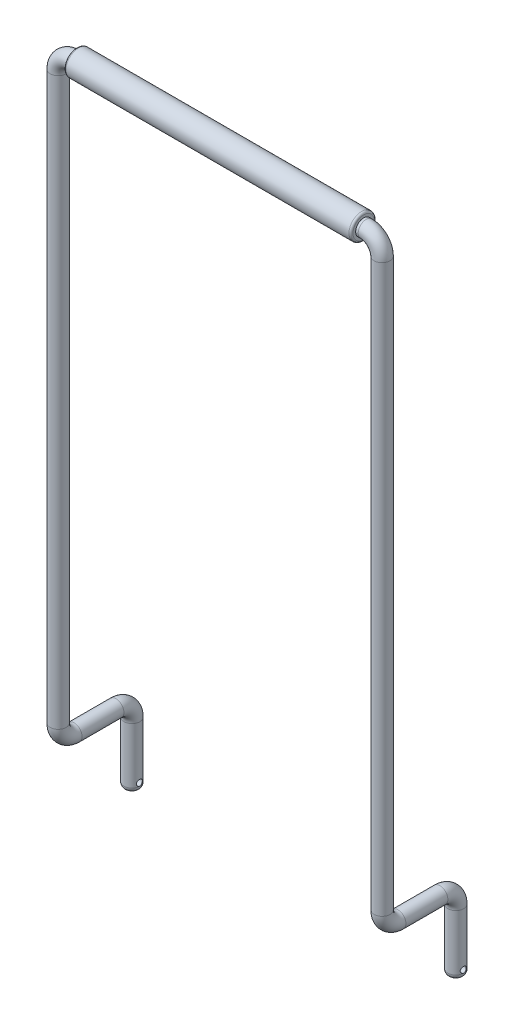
ISO-10303-21;
HEADER;
FILE_DESCRIPTION(('STEP AP214'),'2;1');
FILE_NAME('part.step','',(''),(''),'','','');
FILE_SCHEMA(('AUTOMOTIVE_DESIGN { 1 0 10303 214 1 1 1 1 }'));
ENDSEC;
DATA;
#1=APPLICATION_CONTEXT('core data for automotive mechanical design processes');
#2=APPLICATION_PROTOCOL_DEFINITION('international standard','automotive_design',2000,#1);
#3=PRODUCT_CONTEXT('',#1,'mechanical');
#4=PRODUCT('Part','Part','',(#3));
#5=PRODUCT_RELATED_PRODUCT_CATEGORY('part','',(#4));
#6=PRODUCT_DEFINITION_FORMATION('','',#4);
#7=PRODUCT_DEFINITION_CONTEXT('part definition',#1,'design');
#8=PRODUCT_DEFINITION('design','',#6,#7);
#9=PRODUCT_DEFINITION_SHAPE('','',#8);
#10=(LENGTH_UNIT() NAMED_UNIT(*) SI_UNIT(.MILLI.,.METRE.));
#11=(NAMED_UNIT(*) PLANE_ANGLE_UNIT() SI_UNIT($,.RADIAN.));
#12=(NAMED_UNIT(*) SI_UNIT($,.STERADIAN.) SOLID_ANGLE_UNIT());
#13=UNCERTAINTY_MEASURE_WITH_UNIT(LENGTH_MEASURE(1.E-05),#10,'distance_accuracy_value','');
#14=(GEOMETRIC_REPRESENTATION_CONTEXT(3) GLOBAL_UNCERTAINTY_ASSIGNED_CONTEXT((#13)) GLOBAL_UNIT_ASSIGNED_CONTEXT((#10,
#11,#12)) REPRESENTATION_CONTEXT('',''));
#15=CARTESIAN_POINT('',(0.,0.,0.));
#16=DIRECTION('',(0.,0.,1.));
#17=DIRECTION('',(1.,0.,0.));
#18=AXIS2_PLACEMENT_3D('',#15,#16,#17);
#19=CARTESIAN_POINT('',(72.,0.,0.));
#20=DIRECTION('',(-1.,0.,0.));
#21=DIRECTION('',(0.,0.,1.));
#22=AXIS2_PLACEMENT_3D('',#19,#20,#21);
#23=CYLINDRICAL_SURFACE('',#22,6.35);
#24=CARTESIAN_POINT('',(71.,0.,0.));
#25=DIRECTION('',(1.,0.,0.));
#26=DIRECTION('',(0.,0.,-1.));
#27=AXIS2_PLACEMENT_3D('',#24,#25,#26);
#28=CIRCLE('',#27,6.35);
#29=CARTESIAN_POINT('',(71.,0.,-6.35));
#30=VERTEX_POINT('',#29);
#31=EDGE_CURVE('E53',#30,#30,#28,.F.);
#32=ORIENTED_EDGE('',*,*,#31,.T.);
#33=EDGE_LOOP('',(#32));
#34=FACE_BOUND('',#33,.T.);
#35=CARTESIAN_POINT('',(-71.,0.,0.));
#36=DIRECTION('',(1.,0.,0.));
#37=DIRECTION('',(0.,0.,-1.));
#38=AXIS2_PLACEMENT_3D('',#35,#36,#37);
#39=CIRCLE('',#38,6.35);
#40=CARTESIAN_POINT('',(-71.,0.,-6.35));
#41=VERTEX_POINT('',#40);
#42=EDGE_CURVE('E57',#41,#41,#39,.T.);
#43=ORIENTED_EDGE('',*,*,#42,.T.);
#44=EDGE_LOOP('',(#43));
#45=FACE_BOUND('',#44,.T.);
#46=ADVANCED_FACE('F46',(#34,#45),#23,.T.);
#47=CARTESIAN_POINT('',(72.,0.,0.));
#48=DIRECTION('',(1.,0.,0.));
#49=DIRECTION('',(0.,0.,-1.));
#50=AXIS2_PLACEMENT_3D('',#47,#48,#49);
#51=PLANE('',#50);
#52=CARTESIAN_POINT('',(72.,0.,0.));
#53=DIRECTION('',(1.,0.,0.));
#54=DIRECTION('',(0.,0.,-1.));
#55=AXIS2_PLACEMENT_3D('',#52,#53,#54);
#56=CIRCLE('',#55,5.35);
#57=CARTESIAN_POINT('',(72.,0.,-5.35));
#58=VERTEX_POINT('',#57);
#59=EDGE_CURVE('E61',#58,#58,#56,.T.);
#60=ORIENTED_EDGE('',*,*,#59,.T.);
#61=EDGE_LOOP('',(#60));
#62=FACE_BOUND('',#61,.T.);
#63=ADVANCED_FACE('F67',(#62),#51,.T.);
#64=CARTESIAN_POINT('',(-72.,0.,0.));
#65=DIRECTION('',(1.,0.,0.));
#66=DIRECTION('',(0.,0.,-1.));
#67=AXIS2_PLACEMENT_3D('',#64,#65,#66);
#68=PLANE('',#67);
#69=CARTESIAN_POINT('',(-72.,0.,0.));
#70=DIRECTION('',(1.,0.,0.));
#71=DIRECTION('',(0.,0.,-1.));
#72=AXIS2_PLACEMENT_3D('',#69,#70,#71);
#73=CIRCLE('',#72,5.35);
#74=CARTESIAN_POINT('',(-72.,0.,-5.35));
#75=VERTEX_POINT('',#74);
#76=EDGE_CURVE('E11',#75,#75,#73,.F.);
#77=ORIENTED_EDGE('',*,*,#76,.T.);
#78=EDGE_LOOP('',(#77));
#79=FACE_BOUND('',#78,.T.);
#80=ADVANCED_FACE('F71',(#79),#68,.F.);
#81=CARTESIAN_POINT('',(71.,0.,0.));
#82=DIRECTION('',(1.,0.,0.));
#83=DIRECTION('',(0.,0.,-1.));
#84=AXIS2_PLACEMENT_3D('',#81,#82,#83);
#85=TOROIDAL_SURFACE('',#84,5.35,1.);
#86=ORIENTED_EDGE('',*,*,#31,.F.);
#87=EDGE_LOOP('',(#86));
#88=FACE_BOUND('',#87,.T.);
#89=ORIENTED_EDGE('',*,*,#59,.F.);
#90=EDGE_LOOP('',(#89));
#91=FACE_BOUND('',#90,.T.);
#92=ADVANCED_FACE('F69',(#88,#91),#85,.T.);
#93=CARTESIAN_POINT('',(-71.,0.,0.));
#94=DIRECTION('',(1.,0.,0.));
#95=DIRECTION('',(0.,0.,-1.));
#96=AXIS2_PLACEMENT_3D('',#93,#94,#95);
#97=TOROIDAL_SURFACE('',#96,5.35,1.);
#98=ORIENTED_EDGE('',*,*,#76,.F.);
#99=EDGE_LOOP('',(#98));
#100=FACE_BOUND('',#99,.T.);
#101=ORIENTED_EDGE('',*,*,#42,.F.);
#102=EDGE_LOOP('',(#101));
#103=FACE_BOUND('',#102,.T.);
#104=ADVANCED_FACE('F48',(#100,#103),#97,.T.);
#105=CLOSED_SHELL('',(#46,#63,#80,#92,#104));
#106=MANIFOLD_SOLID_BREP('B2',#105);
#107=CARTESIAN_POINT('',(0.,0.,0.));
#108=DIRECTION('',(-1.,0.,0.));
#109=DIRECTION('',(0.,-1.,0.));
#110=AXIS2_PLACEMENT_3D('',#107,#108,#109);
#111=CYLINDRICAL_SURFACE('',#110,4.);
#112=CARTESIAN_POINT('',(-73.25,0.,0.));
#113=DIRECTION('',(1.,0.,0.));
#114=DIRECTION('',(0.,0.,-1.));
#115=AXIS2_PLACEMENT_3D('',#112,#113,#114);
#116=CIRCLE('',#115,4.);
#117=CARTESIAN_POINT('',(-73.25,3.99999999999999,0.));
#118=VERTEX_POINT('',#117);
#119=EDGE_CURVE('E277',#118,#118,#116,.T.);
#120=ORIENTED_EDGE('',*,*,#119,.T.);
#121=EDGE_LOOP('',(#120));
#122=FACE_BOUND('',#121,.T.);
#123=CARTESIAN_POINT('',(73.25,0.,0.));
#124=DIRECTION('',(1.,0.,0.));
#125=DIRECTION('',(0.,0.,-1.));
#126=AXIS2_PLACEMENT_3D('',#123,#124,#125);
#127=CIRCLE('',#126,4.);
#128=CARTESIAN_POINT('',(73.25,3.99999999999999,0.));
#129=VERTEX_POINT('',#128);
#130=EDGE_CURVE('E259',#129,#129,#127,.F.);
#131=ORIENTED_EDGE('',*,*,#130,.T.);
#132=EDGE_LOOP('',(#131));
#133=FACE_BOUND('',#132,.T.);
#134=ADVANCED_FACE('F116',(#122,#133),#111,.T.);
#135=CARTESIAN_POINT('',(-73.25,-8.00000000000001,0.));
#136=DIRECTION('',(0.,0.,1.));
#137=DIRECTION('',(1.,0.,0.));
#138=AXIS2_PLACEMENT_3D('',#135,#136,#137);
#139=TOROIDAL_SURFACE('',#138,8.,4.);
#140=CARTESIAN_POINT('',(-81.25,-8.00000000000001,0.));
#141=DIRECTION('',(0.,1.,0.));
#142=DIRECTION('',(0.,0.,-1.));
#143=AXIS2_PLACEMENT_3D('',#140,#141,#142);
#144=CIRCLE('',#143,4.);
#145=CARTESIAN_POINT('',(-85.25,-8.00000000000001,0.));
#146=VERTEX_POINT('',#145);
#147=EDGE_CURVE('E279',#146,#146,#144,.T.);
#148=CARTESIAN_POINT('',(-73.25,-8.00000000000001,0.));
#149=DIRECTION('',(0.,0.,1.));
#150=DIRECTION('',(1.,0.,0.));
#151=AXIS2_PLACEMENT_3D('',#148,#149,#150);
#152=CIRCLE('',#151,12.);
#153=EDGE_CURVE('',#118,#146,#152,.T.);
#154=ORIENTED_EDGE('',*,*,#119,.F.);
#155=ORIENTED_EDGE('',*,*,#147,.T.);
#156=ORIENTED_EDGE('',*,*,#153,.T.);
#157=ORIENTED_EDGE('',*,*,#153,.F.);
#158=EDGE_LOOP('',(#154,#156,#155,#157));
#159=FACE_BOUND('',#158,.T.);
#160=ADVANCED_FACE('F224',(#159),#139,.T.);
#161=CARTESIAN_POINT('',(-81.25,-8.00000000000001,0.));
#162=DIRECTION('',(0.,-1.,0.));
#163=DIRECTION('',(1.,0.,0.));
#164=AXIS2_PLACEMENT_3D('',#161,#162,#163);
#165=CYLINDRICAL_SURFACE('',#164,4.);
#166=ORIENTED_EDGE('',*,*,#147,.F.);
#167=EDGE_LOOP('',(#166));
#168=FACE_BOUND('',#167,.T.);
#169=CARTESIAN_POINT('',(-81.25,-292.,0.));
#170=DIRECTION('',(0.,1.,0.));
#171=DIRECTION('',(1.,0.,0.));
#172=AXIS2_PLACEMENT_3D('',#169,#170,#171);
#173=CIRCLE('',#172,4.00000000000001);
#174=CARTESIAN_POINT('',(-81.25,-292.,4.00000000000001));
#175=VERTEX_POINT('',#174);
#176=EDGE_CURVE('E271',#175,#175,#173,.T.);
#177=ORIENTED_EDGE('',*,*,#176,.T.);
#178=EDGE_LOOP('',(#177));
#179=FACE_BOUND('',#178,.T.);
#180=ADVANCED_FACE('F217',(#168,#179),#165,.T.);
#181=CARTESIAN_POINT('',(-81.25,-292.,-8.));
#182=DIRECTION('',(1.,0.,0.));
#183=DIRECTION('',(0.,0.,-1.));
#184=AXIS2_PLACEMENT_3D('',#181,#182,#183);
#185=TOROIDAL_SURFACE('',#184,8.,4.00000000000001);
#186=CARTESIAN_POINT('',(-81.25,-300.,-8.00000000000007));
#187=DIRECTION('',(0.,0.,1.));
#188=DIRECTION('',(1.,0.,0.));
#189=AXIS2_PLACEMENT_3D('',#186,#187,#188);
#190=CIRCLE('',#189,4.00000000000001);
#191=CARTESIAN_POINT('',(-81.25,-304.,-8.0000000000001));
#192=VERTEX_POINT('',#191);
#193=EDGE_CURVE('E274',#192,#192,#190,.T.);
#194=CARTESIAN_POINT('',(-81.25,-292.,-8.));
#195=DIRECTION('',(1.,0.,0.));
#196=DIRECTION('',(0.,0.,-1.));
#197=AXIS2_PLACEMENT_3D('',#194,#195,#196);
#198=CIRCLE('',#197,12.);
#199=EDGE_CURVE('',#175,#192,#198,.T.);
#200=ORIENTED_EDGE('',*,*,#176,.F.);
#201=ORIENTED_EDGE('',*,*,#193,.T.);
#202=ORIENTED_EDGE('',*,*,#199,.T.);
#203=ORIENTED_EDGE('',*,*,#199,.F.);
#204=EDGE_LOOP('',(#200,#202,#201,#203));
#205=FACE_BOUND('',#204,.T.);
#206=ADVANCED_FACE('F206',(#205),#185,.T.);
#207=CARTESIAN_POINT('',(-81.25,-300.,-8.));
#208=DIRECTION('',(0.,0.,-1.));
#209=DIRECTION('',(-1.,0.,0.));
#210=AXIS2_PLACEMENT_3D('',#207,#208,#209);
#211=CYLINDRICAL_SURFACE('',#210,4.00000000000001);
#212=ORIENTED_EDGE('',*,*,#193,.F.);
#213=EDGE_LOOP('',(#212));
#214=FACE_BOUND('',#213,.T.);
#215=CARTESIAN_POINT('',(-81.25,-300.,-29.));
#216=DIRECTION('',(0.,0.,-1.));
#217=DIRECTION('',(-1.,0.,0.));
#218=AXIS2_PLACEMENT_3D('',#215,#216,#217);
#219=CIRCLE('',#218,4.00000000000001);
#220=CARTESIAN_POINT('',(-81.25,-296.,-29.));
#221=VERTEX_POINT('',#220);
#222=EDGE_CURVE('E265',#221,#221,#219,.T.);
#223=ORIENTED_EDGE('',*,*,#222,.F.);
#224=EDGE_LOOP('',(#223));
#225=FACE_BOUND('',#224,.T.);
#226=ADVANCED_FACE('F212',(#214,#225),#211,.T.);
#227=CARTESIAN_POINT('',(-81.25,-338.5,-37.));
#228=DIRECTION('',(0.,-1.,0.));
#229=DIRECTION('',(-1.,0.,0.));
#230=AXIS2_PLACEMENT_3D('',#227,#228,#229);
#231=PLANE('',#230);
#232=CARTESIAN_POINT('',(-81.25,-338.5,-37.));
#233=DIRECTION('',(0.,-1.,0.));
#234=DIRECTION('',(0.,0.,-1.));
#235=AXIS2_PLACEMENT_3D('',#232,#233,#234);
#236=CIRCLE('',#235,1.50000000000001);
#237=CARTESIAN_POINT('',(-81.25,-338.5,-38.5));
#238=VERTEX_POINT('',#237);
#239=EDGE_CURVE('E158',#238,#238,#236,.T.);
#240=ORIENTED_EDGE('',*,*,#239,.T.);
#241=EDGE_LOOP('',(#240));
#242=FACE_BOUND('',#241,.T.);
#243=ADVANCED_FACE('F208',(#242),#231,.T.);
#244=CARTESIAN_POINT('',(-81.25,-308.,-29.));
#245=DIRECTION('',(-1.,0.,0.));
#246=DIRECTION('',(0.,0.,1.));
#247=AXIS2_PLACEMENT_3D('',#244,#245,#246);
#248=TOROIDAL_SURFACE('',#247,8.00000000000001,4.00000000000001);
#249=CARTESIAN_POINT('',(-81.25,-308.,-37.));
#250=DIRECTION('',(0.,-1.,0.));
#251=DIRECTION('',(-1.,0.,0.));
#252=AXIS2_PLACEMENT_3D('',#249,#250,#251);
#253=CIRCLE('',#252,4.00000000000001);
#254=CARTESIAN_POINT('',(-81.25,-308.,-41.));
#255=VERTEX_POINT('',#254);
#256=EDGE_CURVE('E268',#255,#255,#253,.T.);
#257=CARTESIAN_POINT('',(-81.25,-308.,-29.));
#258=DIRECTION('',(-1.,0.,0.));
#259=DIRECTION('',(0.,0.,1.));
#260=AXIS2_PLACEMENT_3D('',#257,#258,#259);
#261=CIRCLE('',#260,12.);
#262=EDGE_CURVE('',#221,#255,#261,.T.);
#263=ORIENTED_EDGE('',*,*,#222,.T.);
#264=ORIENTED_EDGE('',*,*,#256,.F.);
#265=ORIENTED_EDGE('',*,*,#262,.T.);
#266=ORIENTED_EDGE('',*,*,#262,.F.);
#267=EDGE_LOOP('',(#263,#265,#264,#266));
#268=FACE_BOUND('',#267,.T.);
#269=ADVANCED_FACE('F205',(#268),#248,.T.);
#270=CARTESIAN_POINT('',(-81.25,-308.,-37.));
#271=DIRECTION('',(0.,-1.,0.));
#272=DIRECTION('',(0.,0.,-1.));
#273=AXIS2_PLACEMENT_3D('',#270,#271,#272);
#274=CYLINDRICAL_SURFACE('',#273,4.00000000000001);
#275=CARTESIAN_POINT('',(-85.25,-336.,-37.));
#276=CARTESIAN_POINT('',(-85.2500021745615,-336.000002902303,-36.9187649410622));
#277=CARTESIAN_POINT('',(-85.2475037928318,-335.993380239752,-36.8375497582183));
#278=CARTESIAN_POINT('',(-85.2377869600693,-335.96717180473,-36.6775465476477));
#279=CARTESIAN_POINT('',(-85.2305691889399,-335.947587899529,-36.5987581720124));
#280=CARTESIAN_POINT('',(-85.2121883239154,-335.896246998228,-36.4459392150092));
#281=CARTESIAN_POINT('',(-85.2010328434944,-335.864513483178,-36.3718997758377));
#282=CARTESIAN_POINT('',(-85.1758876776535,-335.789893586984,-36.2302006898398));
#283=CARTESIAN_POINT('',(-85.1618972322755,-335.747004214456,-36.1625427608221));
#284=CARTESIAN_POINT('',(-85.1318624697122,-335.649387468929,-36.0326535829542));
#285=CARTESIAN_POINT('',(-85.1157600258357,-335.594269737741,-35.9707292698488));
#286=CARTESIAN_POINT('',(-85.0836022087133,-335.474589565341,-35.8567557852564));
#287=CARTESIAN_POINT('',(-85.0675468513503,-335.410024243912,-35.804709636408));
#288=CARTESIAN_POINT('',(-85.0366247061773,-335.270282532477,-35.7100179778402));
#289=CARTESIAN_POINT('',(-85.0218264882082,-335.194795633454,-35.6678060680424));
#290=CARTESIAN_POINT('',(-84.9959986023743,-335.037151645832,-35.5968135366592));
#291=CARTESIAN_POINT('',(-84.9849674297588,-334.954997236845,-35.5680275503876));
#292=CARTESIAN_POINT('',(-84.9685441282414,-334.789883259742,-35.5259156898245));
#293=CARTESIAN_POINT('',(-84.9629392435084,-334.707094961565,-35.5120040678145));
#294=CARTESIAN_POINT('',(-84.9573806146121,-334.540183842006,-35.4982044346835));
#295=CARTESIAN_POINT('',(-84.957424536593,-334.456061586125,-35.4983106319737));
#296=CARTESIAN_POINT('',(-84.9629751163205,-334.294230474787,-35.5120957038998));
#297=CARTESIAN_POINT('',(-84.9681546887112,-334.216439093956,-35.52496191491));
#298=CARTESIAN_POINT('',(-84.9828493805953,-334.064212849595,-35.5625583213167));
#299=CARTESIAN_POINT('',(-84.9923651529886,-333.989778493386,-35.5872903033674));
#300=CARTESIAN_POINT('',(-85.0148570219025,-333.844722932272,-35.648362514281));
#301=CARTESIAN_POINT('',(-85.0278951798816,-333.774200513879,-35.684913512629));
#302=CARTESIAN_POINT('',(-85.0559421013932,-333.640054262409,-35.768439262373));
#303=CARTESIAN_POINT('',(-85.0709515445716,-333.57643282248,-35.8154176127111));
#304=CARTESIAN_POINT('',(-85.1024803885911,-333.453396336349,-35.9221821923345));
#305=CARTESIAN_POINT('',(-85.1190334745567,-333.394551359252,-35.9826170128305));
#306=CARTESIAN_POINT('',(-85.1509172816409,-333.287662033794,-36.112687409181));
#307=CARTESIAN_POINT('',(-85.1662478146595,-333.239619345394,-36.1823243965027));
#308=CARTESIAN_POINT('',(-85.1942639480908,-333.155069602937,-36.3302765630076));
#309=CARTESIAN_POINT('',(-85.2069049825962,-333.118752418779,-36.4087092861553));
#310=CARTESIAN_POINT('',(-85.2277871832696,-333.06001739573,-36.5711631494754));
#311=CARTESIAN_POINT('',(-85.2360303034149,-333.037593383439,-36.6551817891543));
#312=CARTESIAN_POINT('',(-85.2468444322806,-333.008377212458,-36.8216247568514));
#313=CARTESIAN_POINT('',(-85.2496936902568,-333.000817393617,-36.9038963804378));
#314=CARTESIAN_POINT('',(-85.2502589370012,-332.9993089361,-37.0685724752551));
#315=CARTESIAN_POINT('',(-85.2479760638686,-333.005357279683,-37.1509769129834));
#316=CARTESIAN_POINT('',(-85.2387170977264,-333.030310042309,-37.3102620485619));
#317=CARTESIAN_POINT('',(-85.231924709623,-333.048711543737,-37.3872333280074));
#318=CARTESIAN_POINT('',(-85.2145147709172,-333.097186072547,-37.5369417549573));
#319=CARTESIAN_POINT('',(-85.2038967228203,-333.127260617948,-37.6096783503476));
#320=CARTESIAN_POINT('',(-85.1794962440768,-333.19918641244,-37.7512477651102));
#321=CARTESIAN_POINT('',(-85.1656300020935,-333.241357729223,-37.8199030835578));
#322=CARTESIAN_POINT('',(-85.1362667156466,-333.335918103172,-37.9493927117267));
#323=CARTESIAN_POINT('',(-85.1207690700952,-333.388310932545,-38.0102241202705));
#324=CARTESIAN_POINT('',(-85.0887332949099,-333.505404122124,-38.1260307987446));
#325=CARTESIAN_POINT('',(-85.0721869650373,-333.570642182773,-38.1804615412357));
#326=CARTESIAN_POINT('',(-85.0407881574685,-333.709651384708,-38.2777105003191));
#327=CARTESIAN_POINT('',(-85.025935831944,-333.783423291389,-38.3205276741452));
#328=CARTESIAN_POINT('',(-84.9996682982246,-333.938015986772,-38.39337773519));
#329=CARTESIAN_POINT('',(-84.9882676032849,-334.018864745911,-38.4233568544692));
#330=CARTESIAN_POINT('',(-84.97054032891,-334.185009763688,-38.4690788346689));
#331=CARTESIAN_POINT('',(-84.9642106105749,-334.270303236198,-38.4848305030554));
#332=CARTESIAN_POINT('',(-84.9577589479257,-334.437016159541,-38.5008634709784));
#333=CARTESIAN_POINT('',(-84.9572644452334,-334.518332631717,-38.5020733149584));
#334=CARTESIAN_POINT('',(-84.9615841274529,-334.679945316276,-38.491367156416));
#335=CARTESIAN_POINT('',(-84.966397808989,-334.760241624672,-38.4794523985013));
#336=CARTESIAN_POINT('',(-84.9804814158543,-334.915047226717,-38.4435581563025));
#337=CARTESIAN_POINT('',(-84.9896108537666,-334.989658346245,-38.4199579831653));
#338=CARTESIAN_POINT('',(-85.0112154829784,-335.133905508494,-38.3616969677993));
#339=CARTESIAN_POINT('',(-85.0236915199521,-335.20354028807,-38.3270333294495));
#340=CARTESIAN_POINT('',(-85.0513972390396,-335.339826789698,-38.2455207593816));
#341=CARTESIAN_POINT('',(-85.0667369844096,-335.4061307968,-38.1981283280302));
#342=CARTESIAN_POINT('',(-85.0980624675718,-335.530141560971,-38.0933448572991));
#343=CARTESIAN_POINT('',(-85.1140484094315,-335.587845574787,-38.0359506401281));
#344=CARTESIAN_POINT('',(-85.1459042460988,-335.696201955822,-37.9090803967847));
#345=CARTESIAN_POINT('',(-85.1617210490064,-335.746303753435,-37.839118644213));
#346=CARTESIAN_POINT('',(-85.1905451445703,-335.834022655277,-37.6912132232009));
#347=CARTESIAN_POINT('',(-85.2035522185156,-335.871638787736,-37.6132689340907));
#348=CARTESIAN_POINT('',(-85.2257429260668,-335.934376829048,-37.4479990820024));
#349=CARTESIAN_POINT('',(-85.2347365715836,-335.958887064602,-37.3604134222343));
#350=CARTESIAN_POINT('',(-85.2468624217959,-335.991692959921,-37.1818757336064));
#351=CARTESIAN_POINT('',(-85.2499975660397,-335.999996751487,-37.0909254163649));
#352=CARTESIAN_POINT('',(-85.25,-336.,-37.));
#353=B_SPLINE_CURVE_WITH_KNOTS('',3,(#275,#276,#277,#278,#279,#280,#281,#282,#283,#284,#285,
#286,#287,#288,#289,#290,#291,#292,#293,#294,#295,#296,#297,#298,#299,#300,#301,#302,#303,#304,
#305,#306,#307,#308,#309,#310,#311,#312,#313,#314,#315,#316,#317,#318,#319,#320,#321,#322,#323,
#324,#325,#326,#327,#328,#329,#330,#331,#332,#333,#334,#335,#336,#337,#338,#339,#340,#341,#342,
#343,#344,#345,#346,#347,#348,#349,#350,#351,#352),.UNSPECIFIED.,.T.,.F.,(4,2,2,2,2,2,2,2,2,2,2,
2,2,2,2,2,2,2,2,2,2,2,2,2,2,2,2,2,2,2,2,2,2,2,2,2,2,2,4),(0.,0.243369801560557,
0.486704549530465,0.72957136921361,0.972503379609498,1.22473618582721,1.47704604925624,
1.73896674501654,2.00078269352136,2.25185874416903,2.50283106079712,2.73878345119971,
2.97477138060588,3.2152240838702,3.4557599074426,3.71246153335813,3.96920257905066,
4.22991375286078,4.49050899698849,4.73725019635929,4.98393668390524,5.22114437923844,
5.45838293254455,5.70259221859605,5.94689180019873,6.20536519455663,6.46386178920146,
6.72343066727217,6.98283874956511,7.2255876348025,7.46831350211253,7.70363142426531,
7.93900886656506,8.18672471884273,8.43451941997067,8.6957232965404,8.95694749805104,
9.22948515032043,9.5018860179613),.UNSPECIFIED.);
#354=CARTESIAN_POINT('',(-85.25,-336.,-37.));
#355=VERTEX_POINT('',#354);
#356=EDGE_CURVE('E166',#355,#355,#353,.T.);
#357=ORIENTED_EDGE('',*,*,#356,.F.);
#358=CARTESIAN_POINT('',(-81.25,-336.,-37.));
#359=DIRECTION('',(0.,-1.,0.));
#360=DIRECTION('',(0.,0.,-1.));
#361=AXIS2_PLACEMENT_3D('',#358,#359,#360);
#362=CIRCLE('',#361,4.00000000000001);
#363=CARTESIAN_POINT('',(-77.2499999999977,-336.000000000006,-36.9999999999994));
#364=VERTEX_POINT('',#363);
#365=EDGE_CURVE('E44',#355,#364,#362,.F.);
#366=ORIENTED_EDGE('',*,*,#365,.T.);
#367=CARTESIAN_POINT('',(-77.5419007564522,-334.5,-38.5));
#368=CARTESIAN_POINT('',(-77.5419035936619,-334.418992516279,-38.5000030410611));
#369=CARTESIAN_POINT('',(-77.5392173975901,-334.338005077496,-38.4934159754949));
#370=CARTESIAN_POINT('',(-77.5288384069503,-334.178471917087,-38.4673618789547));
#371=CARTESIAN_POINT('',(-77.5211457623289,-334.099926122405,-38.4478952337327));
#372=CARTESIAN_POINT('',(-77.501745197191,-333.947624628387,-38.3968965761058));
#373=CARTESIAN_POINT('',(-77.4900469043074,-333.873857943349,-38.3653934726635));
#374=CARTESIAN_POINT('',(-77.463968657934,-333.732628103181,-38.291318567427));
#375=CARTESIAN_POINT('',(-77.4495878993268,-333.665166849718,-38.2487434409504));
#376=CARTESIAN_POINT('',(-77.4189642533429,-333.535109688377,-38.1514666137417));
#377=CARTESIAN_POINT('',(-77.402666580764,-333.472871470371,-38.0963038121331));
#378=CARTESIAN_POINT('',(-77.3705024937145,-333.358277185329,-37.976395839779));
#379=CARTESIAN_POINT('',(-77.3546361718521,-333.305923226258,-37.9116486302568));
#380=CARTESIAN_POINT('',(-77.3244712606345,-333.210860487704,-37.7716946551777));
#381=CARTESIAN_POINT('',(-77.3102443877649,-333.168540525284,-37.6962069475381));
#382=CARTESIAN_POINT('',(-77.2856199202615,-333.097348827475,-37.5385557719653));
#383=CARTESIAN_POINT('',(-77.2752209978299,-333.068472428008,-37.4563946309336));
#384=CARTESIAN_POINT('',(-77.2598130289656,-333.026242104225,-37.291489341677));
#385=CARTESIAN_POINT('',(-77.2545908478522,-333.01227237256,-37.2089231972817));
#386=CARTESIAN_POINT('',(-77.2493598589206,-332.998278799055,-37.0424643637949));
#387=CARTESIAN_POINT('',(-77.249349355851,-332.998250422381,-36.9585721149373));
#388=CARTESIAN_POINT('',(-77.2544073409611,-333.011781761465,-36.7962564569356));
#389=CARTESIAN_POINT('',(-77.2592245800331,-333.024669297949,-36.7177678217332));
#390=CARTESIAN_POINT('',(-77.2730672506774,-333.062535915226,-36.5641607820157));
#391=CARTESIAN_POINT('',(-77.2820929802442,-333.087515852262,-36.4890426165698));
#392=CARTESIAN_POINT('',(-77.3036223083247,-333.149170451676,-36.343010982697));
#393=CARTESIAN_POINT('',(-77.3161746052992,-333.186010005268,-36.2721746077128));
#394=CARTESIAN_POINT('',(-77.3434868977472,-333.270192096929,-36.1375133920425));
#395=CARTESIAN_POINT('',(-77.3582476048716,-333.317538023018,-36.0736908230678));
#396=CARTESIAN_POINT('',(-77.3894747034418,-333.424627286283,-35.9509095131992));
#397=CARTESIAN_POINT('',(-77.4059903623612,-333.48493391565,-35.8924538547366));
#398=CARTESIAN_POINT('',(-77.4381753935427,-333.614592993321,-35.7862960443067));
#399=CARTESIAN_POINT('',(-77.4538445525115,-333.683947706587,-35.7385965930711));
#400=CARTESIAN_POINT('',(-77.4828729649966,-333.831719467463,-35.6543438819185));
#401=CARTESIAN_POINT('',(-77.4961732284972,-333.910303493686,-35.6180615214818));
#402=CARTESIAN_POINT('',(-77.51827561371,-334.073096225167,-35.559435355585));
#403=CARTESIAN_POINT('',(-77.5270802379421,-334.157301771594,-35.5370837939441));
#404=CARTESIAN_POINT('',(-77.5386040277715,-334.323975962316,-35.5080980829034));
#405=CARTESIAN_POINT('',(-77.5416321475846,-334.406284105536,-35.5006647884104));
#406=CARTESIAN_POINT('',(-77.5421346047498,-334.571009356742,-35.4994211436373));
#407=CARTESIAN_POINT('',(-77.5396103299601,-334.653426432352,-35.5056073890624));
#408=CARTESIAN_POINT('',(-77.5296061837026,-334.811929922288,-35.5307026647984));
#409=CARTESIAN_POINT('',(-77.5223672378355,-334.888131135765,-35.5489938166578));
#410=CARTESIAN_POINT('',(-77.5040351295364,-335.03634794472,-35.5970022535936));
#411=CARTESIAN_POINT('',(-77.4929411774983,-335.108362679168,-35.6267218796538));
#412=CARTESIAN_POINT('',(-77.4676375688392,-335.249164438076,-35.6979970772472));
#413=CARTESIAN_POINT('',(-77.4533267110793,-335.317729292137,-35.7399545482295));
#414=CARTESIAN_POINT('',(-77.4233718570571,-335.447128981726,-35.8340868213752));
#415=CARTESIAN_POINT('',(-77.4077273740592,-335.507960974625,-35.8862653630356));
#416=CARTESIAN_POINT('',(-77.3756695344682,-335.624168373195,-36.003272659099));
#417=CARTESIAN_POINT('',(-77.3592703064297,-335.678953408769,-36.0686936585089));
#418=CARTESIAN_POINT('',(-77.328501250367,-335.776838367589,-36.2082025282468));
#419=CARTESIAN_POINT('',(-77.3141314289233,-335.819938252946,-36.2822904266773));
#420=CARTESIAN_POINT('',(-77.2890501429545,-335.8929460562,-36.4369836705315));
#421=CARTESIAN_POINT('',(-77.2783261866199,-335.922899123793,-36.5175655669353));
#422=CARTESIAN_POINT('',(-77.2617056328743,-335.96865641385,-36.6831181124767));
#423=CARTESIAN_POINT('',(-77.2558067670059,-335.984467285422,-36.7680866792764));
#424=CARTESIAN_POINT('',(-77.2497159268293,-336.000774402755,-36.9346644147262));
#425=CARTESIAN_POINT('',(-77.2492113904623,-336.002109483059,-37.0161807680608));
#426=CARTESIAN_POINT('',(-77.2531511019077,-335.991584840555,-37.1782267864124));
#427=CARTESIAN_POINT('',(-77.2575947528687,-335.979726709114,-37.2587565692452));
#428=CARTESIAN_POINT('',(-77.2707891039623,-335.943741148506,-37.4145482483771));
#429=CARTESIAN_POINT('',(-77.2794320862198,-335.919920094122,-37.4898907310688));
#430=CARTESIAN_POINT('',(-77.3001221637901,-335.860989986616,-37.6355154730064));
#431=CARTESIAN_POINT('',(-77.3121699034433,-335.825878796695,-37.7057967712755));
#432=CARTESIAN_POINT('',(-77.3390938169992,-335.743686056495,-37.8425401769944));
#433=CARTESIAN_POINT('',(-77.3540675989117,-335.696163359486,-37.9087175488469));
#434=CARTESIAN_POINT('',(-77.3850049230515,-335.591192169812,-38.0324173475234));
#435=CARTESIAN_POINT('',(-77.4009688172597,-335.533740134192,-38.0899366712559));
#436=CARTESIAN_POINT('',(-77.4331187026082,-335.406935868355,-38.197812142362));
#437=CARTESIAN_POINT('',(-77.4492719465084,-335.337115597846,-38.2476299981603));
#438=CARTESIAN_POINT('',(-77.4790167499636,-335.189584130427,-38.3348470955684));
#439=CARTESIAN_POINT('',(-77.4926080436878,-335.111872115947,-38.3722450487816));
#440=CARTESIAN_POINT('',(-77.5159773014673,-334.947044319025,-38.4346588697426));
#441=CARTESIAN_POINT('',(-77.5255619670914,-334.859665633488,-38.4590600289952));
#442=CARTESIAN_POINT('',(-77.5385200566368,-334.681514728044,-38.4917235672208));
#443=CARTESIAN_POINT('',(-77.5418975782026,-334.59074478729,-38.4999965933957));
#444=CARTESIAN_POINT('',(-77.5419007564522,-334.5,-38.5));
#445=B_SPLINE_CURVE_WITH_KNOTS('',3,(#367,#368,#369,#370,#371,#372,#373,#374,#375,#376,#377,
#378,#379,#380,#381,#382,#383,#384,#385,#386,#387,#388,#389,#390,#391,#392,#393,#394,#395,#396,
#397,#398,#399,#400,#401,#402,#403,#404,#405,#406,#407,#408,#409,#410,#411,#412,#413,#414,#415,
#416,#417,#418,#419,#420,#421,#422,#423,#424,#425,#426,#427,#428,#429,#430,#431,#432,#433,#434,
#435,#436,#437,#438,#439,#440,#441,#442,#443,#444),.UNSPECIFIED.,.T.,.F.,(4,2,2,2,2,2,2,2,2,2,2,
2,2,2,2,2,2,2,2,2,2,2,2,2,2,2,2,2,2,2,2,2,2,2,2,2,2,2,4),(0.,0.242684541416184,0.48536181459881,
0.72745985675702,0.969630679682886,1.22274652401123,1.47591628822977,1.73770072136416,
1.99939426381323,2.24980018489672,2.50012465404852,2.7380647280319,2.97602165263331,
3.21744131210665,3.4589389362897,3.71456675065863,3.97025867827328,4.23162592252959,
4.49284751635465,4.73965657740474,4.9864039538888,5.22143845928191,5.45652113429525,
5.7004156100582,5.9443994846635,6.20385016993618,6.46330169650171,6.72185508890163,
6.98028685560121,7.22365720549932,7.46699820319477,7.70440274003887,7.94185223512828,
8.18928323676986,8.4368027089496,8.69738599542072,8.95799630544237,9.23003178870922,
9.50188762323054),.UNSPECIFIED.);
#446=EDGE_CURVE('E163',#364,#364,#445,.T.);
#447=ORIENTED_EDGE('',*,*,#446,.F.);
#448=CARTESIAN_POINT('',(-81.25,-336.,-37.));
#449=DIRECTION('',(0.,-1.,0.));
#450=DIRECTION('',(0.,0.,-1.));
#451=AXIS2_PLACEMENT_3D('',#448,#449,#450);
#452=CIRCLE('',#451,4.00000000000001);
#453=EDGE_CURVE('E124',#364,#355,#452,.F.);
#454=ORIENTED_EDGE('',*,*,#453,.T.);
#455=EDGE_LOOP('',(#357,#366,#447,#454));
#456=FACE_BOUND('',#455,.T.);
#457=ORIENTED_EDGE('',*,*,#256,.T.);
#458=EDGE_LOOP('',(#457));
#459=FACE_BOUND('',#458,.T.);
#460=ADVANCED_FACE('F199',(#456,#459),#274,.T.);
#461=CARTESIAN_POINT('',(73.25,-8.00000000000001,0.));
#462=DIRECTION('',(0.,0.,-1.));
#463=DIRECTION('',(-1.,0.,0.));
#464=AXIS2_PLACEMENT_3D('',#461,#462,#463);
#465=TOROIDAL_SURFACE('',#464,8.,4.);
#466=CARTESIAN_POINT('',(81.25,-8.00000000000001,0.));
#467=DIRECTION('',(0.,-1.,0.));
#468=DIRECTION('',(0.,0.,-1.));
#469=AXIS2_PLACEMENT_3D('',#466,#467,#468);
#470=CIRCLE('',#469,4.);
#471=CARTESIAN_POINT('',(85.25,-8.00000000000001,0.));
#472=VERTEX_POINT('',#471);
#473=EDGE_CURVE('E262',#472,#472,#470,.F.);
#474=CARTESIAN_POINT('',(73.25,-8.00000000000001,0.));
#475=DIRECTION('',(0.,0.,-1.));
#476=DIRECTION('',(-1.,0.,0.));
#477=AXIS2_PLACEMENT_3D('',#474,#475,#476);
#478=CIRCLE('',#477,12.);
#479=EDGE_CURVE('',#129,#472,#478,.T.);
#480=ORIENTED_EDGE('',*,*,#130,.F.);
#481=ORIENTED_EDGE('',*,*,#473,.T.);
#482=ORIENTED_EDGE('',*,*,#479,.T.);
#483=ORIENTED_EDGE('',*,*,#479,.F.);
#484=EDGE_LOOP('',(#480,#482,#481,#483));
#485=FACE_BOUND('',#484,.T.);
#486=ADVANCED_FACE('F204',(#485),#465,.T.);
#487=CARTESIAN_POINT('',(81.25,-8.00000000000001,0.));
#488=DIRECTION('',(0.,-1.,0.));
#489=DIRECTION('',(1.,0.,0.));
#490=AXIS2_PLACEMENT_3D('',#487,#488,#489);
#491=CYLINDRICAL_SURFACE('',#490,4.);
#492=ORIENTED_EDGE('',*,*,#473,.F.);
#493=EDGE_LOOP('',(#492));
#494=FACE_BOUND('',#493,.T.);
#495=CARTESIAN_POINT('',(81.25,-292.,0.));
#496=DIRECTION('',(0.,-1.,0.));
#497=DIRECTION('',(-1.,0.,0.));
#498=AXIS2_PLACEMENT_3D('',#495,#496,#497);
#499=CIRCLE('',#498,4.00000000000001);
#500=CARTESIAN_POINT('',(81.25,-292.,4.00000000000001));
#501=VERTEX_POINT('',#500);
#502=EDGE_CURVE('E251',#501,#501,#499,.F.);
#503=ORIENTED_EDGE('',*,*,#502,.T.);
#504=EDGE_LOOP('',(#503));
#505=FACE_BOUND('',#504,.T.);
#506=ADVANCED_FACE('F214',(#494,#505),#491,.T.);
#507=CARTESIAN_POINT('',(81.25,-292.,-8.));
#508=DIRECTION('',(1.,0.,0.));
#509=DIRECTION('',(0.,0.,-1.));
#510=AXIS2_PLACEMENT_3D('',#507,#508,#509);
#511=TOROIDAL_SURFACE('',#510,8.,4.00000000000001);
#512=CARTESIAN_POINT('',(81.25,-300.,-8.00000000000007));
#513=DIRECTION('',(0.,0.,-1.));
#514=DIRECTION('',(-1.,0.,0.));
#515=AXIS2_PLACEMENT_3D('',#512,#513,#514);
#516=CIRCLE('',#515,4.00000000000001);
#517=CARTESIAN_POINT('',(81.25,-304.,-8.0000000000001));
#518=VERTEX_POINT('',#517);
#519=EDGE_CURVE('E256',#518,#518,#516,.F.);
#520=CARTESIAN_POINT('',(81.25,-292.,-8.));
#521=DIRECTION('',(1.,0.,0.));
#522=DIRECTION('',(0.,0.,-1.));
#523=AXIS2_PLACEMENT_3D('',#520,#521,#522);
#524=CIRCLE('',#523,12.);
#525=EDGE_CURVE('',#501,#518,#524,.T.);
#526=ORIENTED_EDGE('',*,*,#502,.F.);
#527=ORIENTED_EDGE('',*,*,#519,.T.);
#528=ORIENTED_EDGE('',*,*,#525,.T.);
#529=ORIENTED_EDGE('',*,*,#525,.F.);
#530=EDGE_LOOP('',(#526,#528,#527,#529));
#531=FACE_BOUND('',#530,.T.);
#532=ADVANCED_FACE('F293',(#531),#511,.T.);
#533=CARTESIAN_POINT('',(81.25,-300.,-8.));
#534=DIRECTION('',(0.,0.,-1.));
#535=DIRECTION('',(-1.,0.,0.));
#536=AXIS2_PLACEMENT_3D('',#533,#534,#535);
#537=CYLINDRICAL_SURFACE('',#536,4.00000000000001);
#538=ORIENTED_EDGE('',*,*,#519,.F.);
#539=EDGE_LOOP('',(#538));
#540=FACE_BOUND('',#539,.T.);
#541=CARTESIAN_POINT('',(81.25,-300.,-29.));
#542=DIRECTION('',(0.,0.,1.));
#543=DIRECTION('',(1.,0.,0.));
#544=AXIS2_PLACEMENT_3D('',#541,#542,#543);
#545=CIRCLE('',#544,4.00000000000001);
#546=CARTESIAN_POINT('',(81.25,-296.,-29.));
#547=VERTEX_POINT('',#546);
#548=EDGE_CURVE('E245',#547,#547,#545,.F.);
#549=ORIENTED_EDGE('',*,*,#548,.F.);
#550=EDGE_LOOP('',(#549));
#551=FACE_BOUND('',#550,.T.);
#552=ADVANCED_FACE('F286',(#540,#551),#537,.T.);
#553=CARTESIAN_POINT('',(81.25,-338.5,-37.));
#554=DIRECTION('',(0.,-1.,0.));
#555=DIRECTION('',(1.,0.,0.));
#556=AXIS2_PLACEMENT_3D('',#553,#554,#555);
#557=PLANE('',#556);
#558=CARTESIAN_POINT('',(81.25,-338.5,-37.));
#559=DIRECTION('',(0.,-1.,0.));
#560=DIRECTION('',(0.,0.,-1.));
#561=AXIS2_PLACEMENT_3D('',#558,#559,#560);
#562=CIRCLE('',#561,1.50000000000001);
#563=CARTESIAN_POINT('',(81.25,-338.5,-38.5));
#564=VERTEX_POINT('',#563);
#565=EDGE_CURVE('E151',#564,#564,#562,.T.);
#566=ORIENTED_EDGE('',*,*,#565,.T.);
#567=EDGE_LOOP('',(#566));
#568=FACE_BOUND('',#567,.T.);
#569=ADVANCED_FACE('F185',(#568),#557,.T.);
#570=CARTESIAN_POINT('',(81.25,-308.,-29.));
#571=DIRECTION('',(-1.,0.,0.));
#572=DIRECTION('',(0.,0.,1.));
#573=AXIS2_PLACEMENT_3D('',#570,#571,#572);
#574=TOROIDAL_SURFACE('',#573,8.00000000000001,4.00000000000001);
#575=CARTESIAN_POINT('',(81.25,-308.,-37.));
#576=DIRECTION('',(0.,1.,0.));
#577=DIRECTION('',(1.,0.,0.));
#578=AXIS2_PLACEMENT_3D('',#575,#576,#577);
#579=CIRCLE('',#578,4.00000000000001);
#580=CARTESIAN_POINT('',(81.25,-308.,-41.));
#581=VERTEX_POINT('',#580);
#582=EDGE_CURVE('E247',#581,#581,#579,.F.);
#583=CARTESIAN_POINT('',(81.25,-308.,-29.));
#584=DIRECTION('',(-1.,0.,0.));
#585=DIRECTION('',(0.,0.,1.));
#586=AXIS2_PLACEMENT_3D('',#583,#584,#585);
#587=CIRCLE('',#586,12.);
#588=EDGE_CURVE('',#547,#581,#587,.T.);
#589=ORIENTED_EDGE('',*,*,#548,.T.);
#590=ORIENTED_EDGE('',*,*,#582,.F.);
#591=ORIENTED_EDGE('',*,*,#588,.T.);
#592=ORIENTED_EDGE('',*,*,#588,.F.);
#593=EDGE_LOOP('',(#589,#591,#590,#592));
#594=FACE_BOUND('',#593,.T.);
#595=ADVANCED_FACE('F186',(#594),#574,.T.);
#596=CARTESIAN_POINT('',(81.25,-308.,-37.));
#597=DIRECTION('',(0.,-1.,0.));
#598=DIRECTION('',(0.,0.,-1.));
#599=AXIS2_PLACEMENT_3D('',#596,#597,#598);
#600=CYLINDRICAL_SURFACE('',#599,4.00000000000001);
#601=CARTESIAN_POINT('',(84.9580992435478,-334.5,-38.5));
#602=CARTESIAN_POINT('',(84.9580964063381,-334.418992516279,-38.5000030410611));
#603=CARTESIAN_POINT('',(84.9607826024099,-334.338005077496,-38.4934159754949));
#604=CARTESIAN_POINT('',(84.9711615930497,-334.178471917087,-38.4673618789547));
#605=CARTESIAN_POINT('',(84.9788542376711,-334.099926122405,-38.4478952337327));
#606=CARTESIAN_POINT('',(84.998254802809,-333.947624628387,-38.3968965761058));
#607=CARTESIAN_POINT('',(85.0099530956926,-333.873857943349,-38.3653934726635));
#608=CARTESIAN_POINT('',(85.036031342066,-333.732628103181,-38.291318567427));
#609=CARTESIAN_POINT('',(85.0504121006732,-333.665166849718,-38.2487434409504));
#610=CARTESIAN_POINT('',(85.0810357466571,-333.535109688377,-38.1514666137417));
#611=CARTESIAN_POINT('',(85.097333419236,-333.472871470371,-38.0963038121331));
#612=CARTESIAN_POINT('',(85.1294975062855,-333.358277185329,-37.976395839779));
#613=CARTESIAN_POINT('',(85.1453638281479,-333.305923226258,-37.9116486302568));
#614=CARTESIAN_POINT('',(85.1755287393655,-333.210860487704,-37.7716946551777));
#615=CARTESIAN_POINT('',(85.189755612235,-333.168540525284,-37.6962069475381));
#616=CARTESIAN_POINT('',(85.2143800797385,-333.097348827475,-37.5385557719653));
#617=CARTESIAN_POINT('',(85.2247790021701,-333.068472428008,-37.4563946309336));
#618=CARTESIAN_POINT('',(85.2401869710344,-333.026242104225,-37.291489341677));
#619=CARTESIAN_POINT('',(85.2454091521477,-333.01227237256,-37.2089231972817));
#620=CARTESIAN_POINT('',(85.2506401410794,-332.998278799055,-37.0424643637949));
#621=CARTESIAN_POINT('',(85.250650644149,-332.998250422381,-36.9585721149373));
#622=CARTESIAN_POINT('',(85.2455926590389,-333.011781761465,-36.7962564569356));
#623=CARTESIAN_POINT('',(85.2407754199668,-333.024669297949,-36.7177678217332));
#624=CARTESIAN_POINT('',(85.2269327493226,-333.062535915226,-36.5641607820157));
#625=CARTESIAN_POINT('',(85.2179070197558,-333.087515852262,-36.4890426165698));
#626=CARTESIAN_POINT('',(85.1963776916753,-333.149170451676,-36.343010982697));
#627=CARTESIAN_POINT('',(85.1838253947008,-333.186010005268,-36.2721746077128));
#628=CARTESIAN_POINT('',(85.1565131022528,-333.270192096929,-36.1375133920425));
#629=CARTESIAN_POINT('',(85.1417523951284,-333.317538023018,-36.0736908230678));
#630=CARTESIAN_POINT('',(85.1105252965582,-333.424627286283,-35.9509095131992));
#631=CARTESIAN_POINT('',(85.0940096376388,-333.48493391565,-35.8924538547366));
#632=CARTESIAN_POINT('',(85.0618246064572,-333.614592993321,-35.7862960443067));
#633=CARTESIAN_POINT('',(85.0461554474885,-333.683947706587,-35.7385965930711));
#634=CARTESIAN_POINT('',(85.0171270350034,-333.831719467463,-35.6543438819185));
#635=CARTESIAN_POINT('',(85.0038267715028,-333.910303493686,-35.6180615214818));
#636=CARTESIAN_POINT('',(84.98172438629,-334.073096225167,-35.559435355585));
#637=CARTESIAN_POINT('',(84.9729197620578,-334.157301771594,-35.5370837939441));
#638=CARTESIAN_POINT('',(84.9613959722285,-334.323975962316,-35.5080980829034));
#639=CARTESIAN_POINT('',(84.9583678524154,-334.406284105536,-35.5006647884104));
#640=CARTESIAN_POINT('',(84.9578653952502,-334.571009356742,-35.4994211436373));
#641=CARTESIAN_POINT('',(84.9603896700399,-334.653426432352,-35.5056073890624));
#642=CARTESIAN_POINT('',(84.9703938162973,-334.811929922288,-35.5307026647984));
#643=CARTESIAN_POINT('',(84.9776327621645,-334.888131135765,-35.5489938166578));
#644=CARTESIAN_POINT('',(84.9959648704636,-335.03634794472,-35.5970022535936));
#645=CARTESIAN_POINT('',(85.0070588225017,-335.108362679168,-35.6267218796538));
#646=CARTESIAN_POINT('',(85.0323624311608,-335.249164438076,-35.6979970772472));
#647=CARTESIAN_POINT('',(85.0466732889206,-335.317729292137,-35.7399545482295));
#648=CARTESIAN_POINT('',(85.0766281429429,-335.447128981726,-35.8340868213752));
#649=CARTESIAN_POINT('',(85.0922726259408,-335.507960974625,-35.8862653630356));
#650=CARTESIAN_POINT('',(85.1243304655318,-335.624168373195,-36.003272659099));
#651=CARTESIAN_POINT('',(85.1407296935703,-335.678953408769,-36.0686936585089));
#652=CARTESIAN_POINT('',(85.171498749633,-335.776838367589,-36.2082025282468));
#653=CARTESIAN_POINT('',(85.1858685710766,-335.819938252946,-36.2822904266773));
#654=CARTESIAN_POINT('',(85.2109498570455,-335.8929460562,-36.4369836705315));
#655=CARTESIAN_POINT('',(85.2216738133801,-335.922899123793,-36.5175655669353));
#656=CARTESIAN_POINT('',(85.2382943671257,-335.96865641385,-36.6831181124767));
#657=CARTESIAN_POINT('',(85.2441932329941,-335.984467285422,-36.7680866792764));
#658=CARTESIAN_POINT('',(85.2502840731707,-336.000774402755,-36.9346644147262));
#659=CARTESIAN_POINT('',(85.2507886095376,-336.002109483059,-37.0161807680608));
#660=CARTESIAN_POINT('',(85.2468488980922,-335.991584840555,-37.1782267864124));
#661=CARTESIAN_POINT('',(85.2424052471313,-335.979726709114,-37.2587565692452));
#662=CARTESIAN_POINT('',(85.2292108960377,-335.943741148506,-37.4145482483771));
#663=CARTESIAN_POINT('',(85.2205679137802,-335.919920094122,-37.4898907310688));
#664=CARTESIAN_POINT('',(85.1998778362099,-335.860989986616,-37.6355154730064));
#665=CARTESIAN_POINT('',(85.1878300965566,-335.825878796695,-37.7057967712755));
#666=CARTESIAN_POINT('',(85.1609061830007,-335.743686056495,-37.8425401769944));
#667=CARTESIAN_POINT('',(85.1459324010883,-335.696163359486,-37.9087175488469));
#668=CARTESIAN_POINT('',(85.1149950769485,-335.591192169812,-38.0324173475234));
#669=CARTESIAN_POINT('',(85.0990311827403,-335.533740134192,-38.0899366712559));
#670=CARTESIAN_POINT('',(85.0668812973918,-335.406935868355,-38.197812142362));
#671=CARTESIAN_POINT('',(85.0507280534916,-335.337115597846,-38.2476299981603));
#672=CARTESIAN_POINT('',(85.0209832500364,-335.189584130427,-38.3348470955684));
#673=CARTESIAN_POINT('',(85.0073919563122,-335.111872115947,-38.3722450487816));
#674=CARTESIAN_POINT('',(84.9840226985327,-334.947044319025,-38.4346588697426));
#675=CARTESIAN_POINT('',(84.9744380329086,-334.859665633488,-38.4590600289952));
#676=CARTESIAN_POINT('',(84.9614799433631,-334.681514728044,-38.4917235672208));
#677=CARTESIAN_POINT('',(84.9581024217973,-334.59074478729,-38.4999965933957));
#678=CARTESIAN_POINT('',(84.9580992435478,-334.5,-38.5));
#679=B_SPLINE_CURVE_WITH_KNOTS('',3,(#601,#602,#603,#604,#605,#606,#607,#608,#609,#610,#611,
#612,#613,#614,#615,#616,#617,#618,#619,#620,#621,#622,#623,#624,#625,#626,#627,#628,#629,#630,
#631,#632,#633,#634,#635,#636,#637,#638,#639,#640,#641,#642,#643,#644,#645,#646,#647,#648,#649,
#650,#651,#652,#653,#654,#655,#656,#657,#658,#659,#660,#661,#662,#663,#664,#665,#666,#667,#668,
#669,#670,#671,#672,#673,#674,#675,#676,#677,#678),.UNSPECIFIED.,.T.,.F.,(4,2,2,2,2,2,2,2,2,2,2,
2,2,2,2,2,2,2,2,2,2,2,2,2,2,2,2,2,2,2,2,2,2,2,2,2,2,2,4),(0.,0.242684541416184,0.48536181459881,
0.72745985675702,0.969630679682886,1.22274652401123,1.47591628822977,1.73770072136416,
1.99939426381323,2.24980018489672,2.50012465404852,2.7380647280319,2.97602165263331,
3.21744131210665,3.4589389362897,3.71456675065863,3.97025867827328,4.23162592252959,
4.49284751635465,4.73965657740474,4.9864039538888,5.22143845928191,5.45652113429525,
5.7004156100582,5.9443994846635,6.20385016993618,6.46330169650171,6.72185508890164,
6.98028685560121,7.22365720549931,7.46699820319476,7.70440274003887,7.94185223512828,
8.18928323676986,8.4368027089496,8.69738599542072,8.95799630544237,9.23003178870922,
9.50188762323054),.UNSPECIFIED.);
#680=CARTESIAN_POINT('',(85.2500000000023,-336.000000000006,-36.9999999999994));
#681=VERTEX_POINT('',#680);
#682=EDGE_CURVE('E157',#681,#681,#679,.T.);
#683=ORIENTED_EDGE('',*,*,#682,.F.);
#684=CARTESIAN_POINT('',(81.25,-336.,-37.));
#685=DIRECTION('',(0.,-1.,0.));
#686=DIRECTION('',(0.,0.,-1.));
#687=AXIS2_PLACEMENT_3D('',#684,#685,#686);
#688=CIRCLE('',#687,4.00000000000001);
#689=CARTESIAN_POINT('',(77.2499999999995,-336.000000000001,-36.9999999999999));
#690=VERTEX_POINT('',#689);
#691=EDGE_CURVE('E146',#681,#690,#688,.F.);
#692=ORIENTED_EDGE('',*,*,#691,.T.);
#693=CARTESIAN_POINT('',(77.5419007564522,-334.5,-38.5));
#694=CARTESIAN_POINT('',(77.5419035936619,-334.581007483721,-38.5000030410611));
#695=CARTESIAN_POINT('',(77.5392173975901,-334.661994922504,-38.4934159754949));
#696=CARTESIAN_POINT('',(77.5288384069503,-334.821528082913,-38.4673618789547));
#697=CARTESIAN_POINT('',(77.5211457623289,-334.900073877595,-38.4478952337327));
#698=CARTESIAN_POINT('',(77.501745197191,-335.052375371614,-38.3968965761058));
#699=CARTESIAN_POINT('',(77.4900469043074,-335.126142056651,-38.3653934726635));
#700=CARTESIAN_POINT('',(77.463968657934,-335.267371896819,-38.291318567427));
#701=CARTESIAN_POINT('',(77.4495878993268,-335.334833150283,-38.2487434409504));
#702=CARTESIAN_POINT('',(77.4189642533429,-335.464890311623,-38.1514666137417));
#703=CARTESIAN_POINT('',(77.402666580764,-335.527128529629,-38.0963038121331));
#704=CARTESIAN_POINT('',(77.3705024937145,-335.641722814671,-37.976395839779));
#705=CARTESIAN_POINT('',(77.3546361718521,-335.694076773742,-37.9116486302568));
#706=CARTESIAN_POINT('',(77.3244712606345,-335.789139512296,-37.7716946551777));
#707=CARTESIAN_POINT('',(77.3102443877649,-335.831459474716,-37.6962069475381));
#708=CARTESIAN_POINT('',(77.2856199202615,-335.902651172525,-37.5385557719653));
#709=CARTESIAN_POINT('',(77.2752209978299,-335.931527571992,-37.4563946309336));
#710=CARTESIAN_POINT('',(77.2598130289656,-335.973757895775,-37.291489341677));
#711=CARTESIAN_POINT('',(77.2545908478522,-335.987727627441,-37.2089231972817));
#712=CARTESIAN_POINT('',(77.2493598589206,-336.001721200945,-37.0424643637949));
#713=CARTESIAN_POINT('',(77.249349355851,-336.001749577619,-36.9585721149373));
#714=CARTESIAN_POINT('',(77.2544073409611,-335.988218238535,-36.7962564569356));
#715=CARTESIAN_POINT('',(77.2592245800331,-335.975330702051,-36.7177678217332));
#716=CARTESIAN_POINT('',(77.2730672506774,-335.937464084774,-36.5641607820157));
#717=CARTESIAN_POINT('',(77.2820929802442,-335.912484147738,-36.4890426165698));
#718=CARTESIAN_POINT('',(77.3036223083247,-335.850829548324,-36.343010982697));
#719=CARTESIAN_POINT('',(77.3161746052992,-335.813989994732,-36.2721746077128));
#720=CARTESIAN_POINT('',(77.3434868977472,-335.729807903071,-36.1375133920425));
#721=CARTESIAN_POINT('',(77.3582476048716,-335.682461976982,-36.0736908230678));
#722=CARTESIAN_POINT('',(77.3894747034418,-335.575372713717,-35.9509095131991));
#723=CARTESIAN_POINT('',(77.4059903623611,-335.51506608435,-35.8924538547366));
#724=CARTESIAN_POINT('',(77.4381753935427,-335.385407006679,-35.7862960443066));
#725=CARTESIAN_POINT('',(77.4538445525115,-335.316052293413,-35.7385965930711));
#726=CARTESIAN_POINT('',(77.4828729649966,-335.168280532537,-35.6543438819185));
#727=CARTESIAN_POINT('',(77.4961732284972,-335.089696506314,-35.6180615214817));
#728=CARTESIAN_POINT('',(77.5182756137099,-334.926903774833,-35.559435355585));
#729=CARTESIAN_POINT('',(77.5270802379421,-334.842698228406,-35.5370837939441));
#730=CARTESIAN_POINT('',(77.5386040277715,-334.676024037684,-35.5080980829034));
#731=CARTESIAN_POINT('',(77.5416321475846,-334.593715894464,-35.5006647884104));
#732=CARTESIAN_POINT('',(77.5421346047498,-334.428990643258,-35.4994211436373));
#733=CARTESIAN_POINT('',(77.5396103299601,-334.346573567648,-35.5056073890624));
#734=CARTESIAN_POINT('',(77.5296061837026,-334.188070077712,-35.5307026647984));
#735=CARTESIAN_POINT('',(77.5223672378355,-334.111868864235,-35.5489938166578));
#736=CARTESIAN_POINT('',(77.5040351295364,-333.96365205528,-35.5970022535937));
#737=CARTESIAN_POINT('',(77.4929411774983,-333.891637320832,-35.6267218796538));
#738=CARTESIAN_POINT('',(77.4676375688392,-333.750835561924,-35.6979970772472));
#739=CARTESIAN_POINT('',(77.4533267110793,-333.682270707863,-35.7399545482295));
#740=CARTESIAN_POINT('',(77.4233718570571,-333.552871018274,-35.8340868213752));
#741=CARTESIAN_POINT('',(77.4077273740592,-333.492039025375,-35.8862653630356));
#742=CARTESIAN_POINT('',(77.3756695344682,-333.375831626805,-36.003272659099));
#743=CARTESIAN_POINT('',(77.3592703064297,-333.321046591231,-36.0686936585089));
#744=CARTESIAN_POINT('',(77.328501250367,-333.223161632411,-36.2082025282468));
#745=CARTESIAN_POINT('',(77.3141314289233,-333.180061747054,-36.2822904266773));
#746=CARTESIAN_POINT('',(77.2890501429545,-333.1070539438,-36.4369836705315));
#747=CARTESIAN_POINT('',(77.2783261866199,-333.077100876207,-36.5175655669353));
#748=CARTESIAN_POINT('',(77.2617056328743,-333.03134358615,-36.6831181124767));
#749=CARTESIAN_POINT('',(77.2558067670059,-333.015532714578,-36.7680866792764));
#750=CARTESIAN_POINT('',(77.2497159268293,-332.999225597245,-36.9346644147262));
#751=CARTESIAN_POINT('',(77.2492113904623,-332.997890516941,-37.0161807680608));
#752=CARTESIAN_POINT('',(77.2531511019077,-333.008415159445,-37.1782267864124));
#753=CARTESIAN_POINT('',(77.2575947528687,-333.020273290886,-37.2587565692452));
#754=CARTESIAN_POINT('',(77.2707891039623,-333.056258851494,-37.4145482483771));
#755=CARTESIAN_POINT('',(77.2794320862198,-333.080079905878,-37.4898907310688));
#756=CARTESIAN_POINT('',(77.3001221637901,-333.139010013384,-37.6355154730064));
#757=CARTESIAN_POINT('',(77.3121699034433,-333.174121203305,-37.7057967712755));
#758=CARTESIAN_POINT('',(77.3390938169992,-333.256313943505,-37.8425401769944));
#759=CARTESIAN_POINT('',(77.3540675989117,-333.303836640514,-37.9087175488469));
#760=CARTESIAN_POINT('',(77.3850049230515,-333.408807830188,-38.0324173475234));
#761=CARTESIAN_POINT('',(77.4009688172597,-333.466259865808,-38.0899366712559));
#762=CARTESIAN_POINT('',(77.4331187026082,-333.593064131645,-38.197812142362));
#763=CARTESIAN_POINT('',(77.4492719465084,-333.662884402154,-38.2476299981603));
#764=CARTESIAN_POINT('',(77.4790167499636,-333.810415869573,-38.3348470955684));
#765=CARTESIAN_POINT('',(77.4926080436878,-333.888127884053,-38.3722450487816));
#766=CARTESIAN_POINT('',(77.5159773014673,-334.052955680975,-38.4346588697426));
#767=CARTESIAN_POINT('',(77.5255619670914,-334.140334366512,-38.4590600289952));
#768=CARTESIAN_POINT('',(77.5385200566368,-334.318485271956,-38.4917235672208));
#769=CARTESIAN_POINT('',(77.5418975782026,-334.40925521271,-38.4999965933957));
#770=CARTESIAN_POINT('',(77.5419007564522,-334.5,-38.5));
#771=B_SPLINE_CURVE_WITH_KNOTS('',3,(#693,#694,#695,#696,#697,#698,#699,#700,#701,#702,#703,
#704,#705,#706,#707,#708,#709,#710,#711,#712,#713,#714,#715,#716,#717,#718,#719,#720,#721,#722,
#723,#724,#725,#726,#727,#728,#729,#730,#731,#732,#733,#734,#735,#736,#737,#738,#739,#740,#741,
#742,#743,#744,#745,#746,#747,#748,#749,#750,#751,#752,#753,#754,#755,#756,#757,#758,#759,#760,
#761,#762,#763,#764,#765,#766,#767,#768,#769,#770),.UNSPECIFIED.,.T.,.F.,(4,2,2,2,2,2,2,2,2,2,2,
2,2,2,2,2,2,2,2,2,2,2,2,2,2,2,2,2,2,2,2,2,2,2,2,2,2,2,4),(0.,0.242684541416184,0.48536181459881,
0.72745985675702,0.969630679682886,1.22274652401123,1.47591628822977,1.73770072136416,
1.99939426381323,2.24980018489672,2.50012465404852,2.7380647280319,2.97602165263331,
3.21744131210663,3.4589389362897,3.71456675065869,3.97025867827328,4.23162592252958,
4.49284751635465,4.73965657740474,4.9864039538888,5.22143845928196,5.45652113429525,
5.7004156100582,5.94439948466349,6.20385016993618,6.4633016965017,6.72185508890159,
6.98028685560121,7.22365720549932,7.46699820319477,7.70440274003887,7.94185223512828,
8.18928323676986,8.4368027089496,8.69738599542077,8.95799630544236,9.23003178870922,
9.50188762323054),.UNSPECIFIED.);
#772=EDGE_CURVE('E156',#690,#690,#771,.T.);
#773=ORIENTED_EDGE('',*,*,#772,.F.);
#774=CARTESIAN_POINT('',(81.25,-336.,-37.));
#775=DIRECTION('',(0.,-1.,0.));
#776=DIRECTION('',(0.,0.,-1.));
#777=AXIS2_PLACEMENT_3D('',#774,#775,#776);
#778=CIRCLE('',#777,4.00000000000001);
#779=EDGE_CURVE('E142',#690,#681,#778,.F.);
#780=ORIENTED_EDGE('',*,*,#779,.T.);
#781=EDGE_LOOP('',(#683,#692,#773,#780));
#782=FACE_BOUND('',#781,.T.);
#783=ORIENTED_EDGE('',*,*,#582,.T.);
#784=EDGE_LOOP('',(#783));
#785=FACE_BOUND('',#784,.T.);
#786=ADVANCED_FACE('F154',(#782,#785),#600,.T.);
#787=CARTESIAN_POINT('',(-85.25,-334.5,-37.));
#788=DIRECTION('',(1.,0.,0.));
#789=DIRECTION('',(0.,0.,-1.));
#790=AXIS2_PLACEMENT_3D('',#787,#788,#789);
#791=CYLINDRICAL_SURFACE('',#790,1.5);
#792=ORIENTED_EDGE('',*,*,#772,.T.);
#793=EDGE_LOOP('',(#792));
#794=FACE_BOUND('',#793,.T.);
#795=ORIENTED_EDGE('',*,*,#682,.T.);
#796=EDGE_LOOP('',(#795));
#797=FACE_BOUND('',#796,.T.);
#798=ADVANCED_FACE('F161',(#794,#797),#791,.F.);
#799=ORIENTED_EDGE('',*,*,#356,.T.);
#800=EDGE_LOOP('',(#799));
#801=FACE_BOUND('',#800,.T.);
#802=ORIENTED_EDGE('',*,*,#446,.T.);
#803=EDGE_LOOP('',(#802));
#804=FACE_BOUND('',#803,.T.);
#805=ADVANCED_FACE('F184',(#801,#804),#791,.F.);
#806=CARTESIAN_POINT('',(81.25,-336.,-37.));
#807=DIRECTION('',(0.,-1.,0.));
#808=DIRECTION('',(0.,0.,-1.));
#809=AXIS2_PLACEMENT_3D('',#806,#807,#808);
#810=DEGENERATE_TOROIDAL_SURFACE('',#809,1.50000000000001,2.5,.T.);
#811=ORIENTED_EDGE('',*,*,#779,.F.);
#812=ORIENTED_EDGE('',*,*,#691,.F.);
#813=EDGE_LOOP('',(#811,#812));
#814=FACE_BOUND('',#813,.T.);
#815=ORIENTED_EDGE('',*,*,#565,.F.);
#816=EDGE_LOOP('',(#815));
#817=FACE_BOUND('',#816,.T.);
#818=ADVANCED_FACE('F144',(#814,#817),#810,.T.);
#819=CARTESIAN_POINT('',(-81.25,-336.,-37.));
#820=DIRECTION('',(0.,-1.,0.));
#821=DIRECTION('',(0.,0.,-1.));
#822=AXIS2_PLACEMENT_3D('',#819,#820,#821);
#823=DEGENERATE_TOROIDAL_SURFACE('',#822,1.50000000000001,2.5,.T.);
#824=ORIENTED_EDGE('',*,*,#453,.F.);
#825=ORIENTED_EDGE('',*,*,#365,.F.);
#826=EDGE_LOOP('',(#824,#825));
#827=FACE_BOUND('',#826,.T.);
#828=ORIENTED_EDGE('',*,*,#239,.F.);
#829=EDGE_LOOP('',(#828));
#830=FACE_BOUND('',#829,.T.);
#831=ADVANCED_FACE('F118',(#827,#830),#823,.T.);
#832=CLOSED_SHELL('',(#134,#160,#180,#206,#226,#243,#269,#460,#486,#506,#532,#552,#569,#595,
#786,#798,#805,#818,#831));
#833=MANIFOLD_SOLID_BREP('B6',#832);
#834=ADVANCED_BREP_SHAPE_REPRESENTATION('',(#18,#106,#833),#14);
#835=SHAPE_DEFINITION_REPRESENTATION(#9,#834);
ENDSEC;
END-ISO-10303-21;
